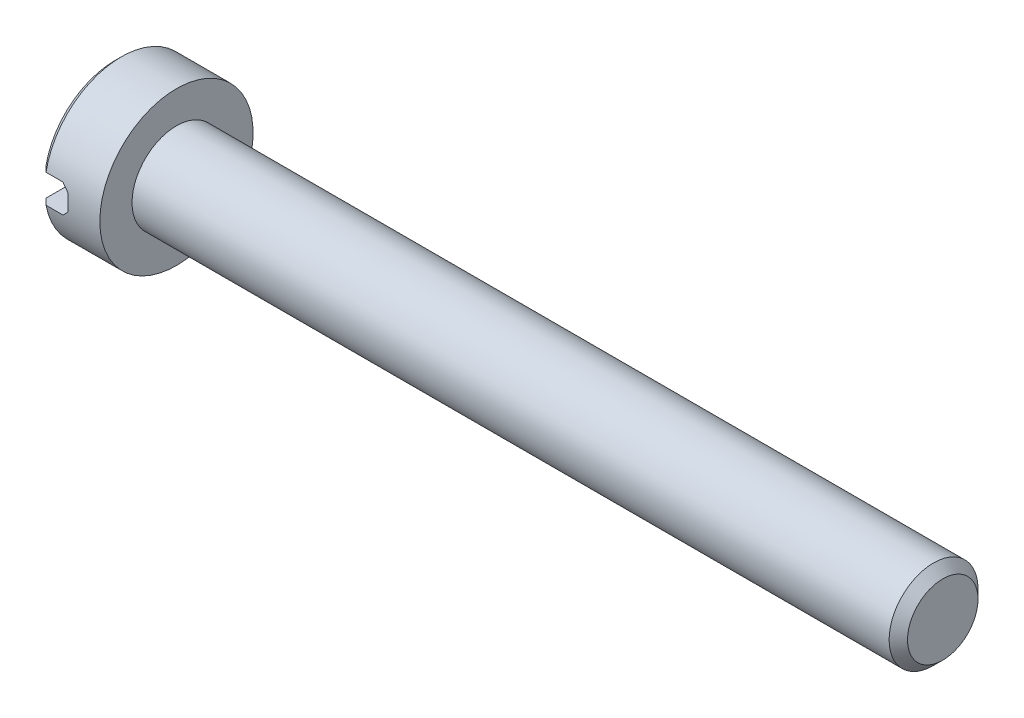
from build123d import *

# Parameters (mm, degrees)
ENL_V_MAT_EXTRU_1_DEPTH = 5
ESQUISSE3_R             = 1.45
EXTRUSION1_DEPTH        = 25
CHANFREIN1_SIZE         = 0.3


with BuildPart() as part:
    # Esquisse1 → R_volution1 (revolve)
    with BuildSketch(Plane.XY, mode=Mode.PRIVATE) as r_volution1_sk:
        Polygon((0, 0), (0, 2.3), (0.2, 2.5), (2, 2.5), (2, 0), align=None)
    revolve(r_volution1_sk.sketch.rotate(Axis((0, 0, 0), (1, 0, 0)), 90), axis=Axis((0, 0, 0), (1, 0, 0)))

    # Esquisse2 → Enl_v. mat.-Extru.1 (cut, symmetric)
    with BuildSketch(Plane.XY):
        Polygon((0, 0.465549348), (0.753445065, 0.465549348), (0.953445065, 0.265549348), (0.953445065, -0.265549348), (0.753445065, -0.465549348), (0, -0.465549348), align=None)
    extrude(amount=ENL_V_MAT_EXTRU_1_DEPTH, both=True, mode=Mode.SUBTRACT)

    # Esquisse3 → Extrusion1 (add)
    with BuildSketch(Plane(origin=(2, 0, 0), x_dir=(0, 0, -1), z_dir=(1, 0, 0))):
        with Locations(Location((0, 0, 0), (0, 0, 180))):
            Circle(ESQUISSE3_R)
    extrude(amount=EXTRUSION1_DEPTH)

    # Chanfrein1
    chanfrein1_edges = [part.edges().sort_by_distance(p)[0] for p in [
        (27, 0, -1.45),
    ]]
    chamfer(chanfrein1_edges, length=CHANFREIN1_SIZE)


solid = part.part
